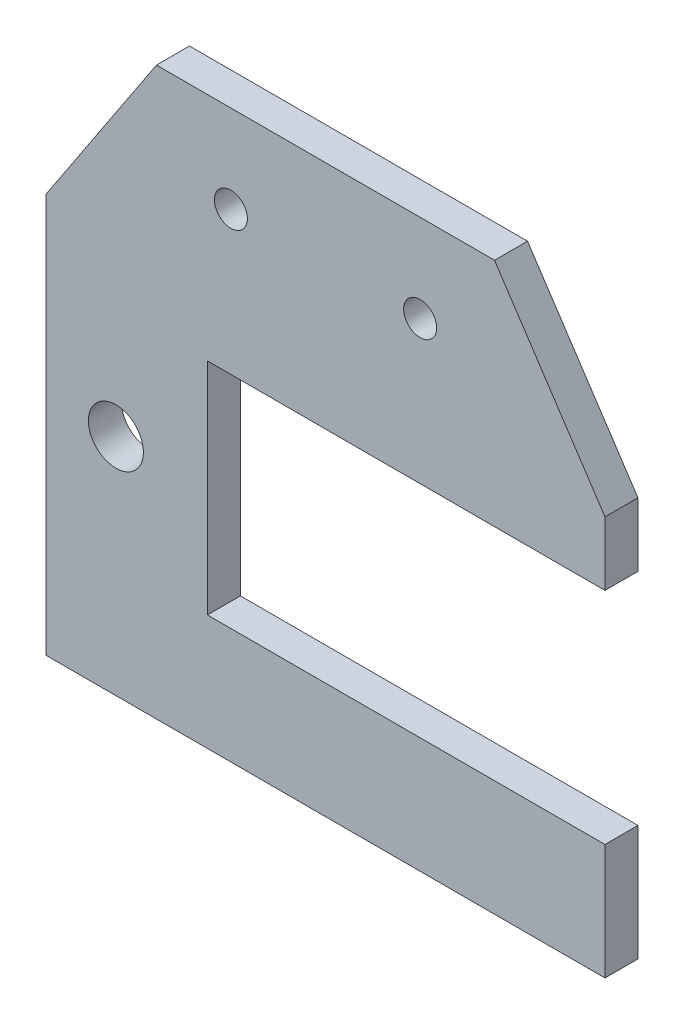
from build123d import *

# Parameters (mm, degrees)
SKETCH1_R           = 2.5
SKETCH1_R_2         = 1.5
SKETCH1_W           = 25.402305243
SKETCH1_H           = 10.51
BOSS_EXTRUDE1_DEPTH = 3


with BuildPart() as part:
    # Sketch1 → Boss-Extrude1 (new body)
    # profile 1 of 3: a face of its own
    with BuildSketch(Plane.XY):
        Polygon((-25.402305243, -12.3212841), (0, -12.3212841), (0, -1.8112841), (-10.737694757, -1.8112841), (-10.737694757, 18.1887159), (0, 18.1887159), (0, 39.160695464), (-15.365, 39.160695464), (-25.402305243, 23.9787159), align=None)
        with Locations((-19.052305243, 8.0787159)):
            Circle(SKETCH1_R, mode=Mode.SUBTRACT)
        with Locations((-8.602305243, 31.190695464)):
            Circle(SKETCH1_R_2, mode=Mode.SUBTRACT)
    # profile 2 of 3: a face of its own
    with BuildSketch(Plane.XY):
        Polygon((0, 39.160695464), (0, 18.1887159), (25.402305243, 18.1887159), (25.402305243, 23.9787159), (15.365, 39.160695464), align=None)
        with Locations((8.602305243, 31.190695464)):
            Circle(SKETCH1_R_2, mode=Mode.SUBTRACT)
    # profile 3 of 3: a face of its own
    with BuildSketch(Plane.XY):
        with Locations((12.701152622, -7.0662841)):
            Rectangle(SKETCH1_W, SKETCH1_H)
    extrude(amount=BOSS_EXTRUDE1_DEPTH)


solid = part.part
